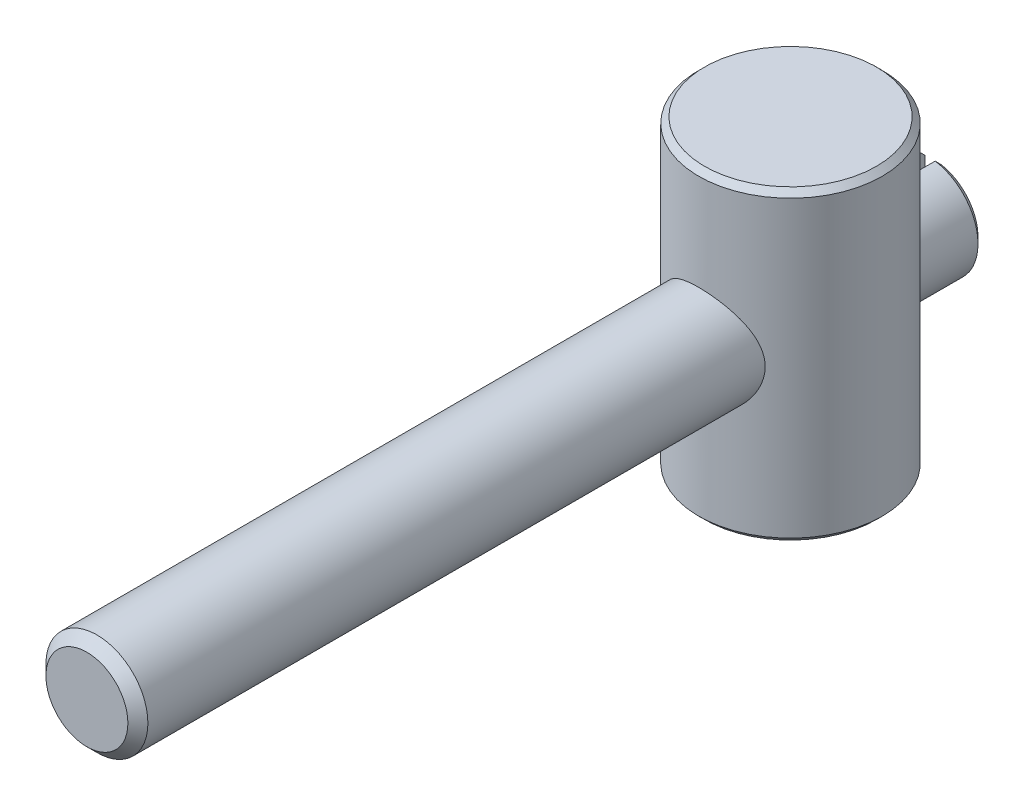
ISO-10303-21;
HEADER;
FILE_DESCRIPTION(('STEP AP214'),'2;1');
FILE_NAME('part.step','',(''),(''),'','','');
FILE_SCHEMA(('AUTOMOTIVE_DESIGN { 1 0 10303 214 1 1 1 1 }'));
ENDSEC;
DATA;
#1=APPLICATION_CONTEXT('core data for automotive mechanical design processes');
#2=APPLICATION_PROTOCOL_DEFINITION('international standard','automotive_design',2000,#1);
#3=PRODUCT_CONTEXT('',#1,'mechanical');
#4=PRODUCT('Part','Part','',(#3));
#5=PRODUCT_RELATED_PRODUCT_CATEGORY('part','',(#4));
#6=PRODUCT_DEFINITION_FORMATION('','',#4);
#7=PRODUCT_DEFINITION_CONTEXT('part definition',#1,'design');
#8=PRODUCT_DEFINITION('design','',#6,#7);
#9=PRODUCT_DEFINITION_SHAPE('','',#8);
#10=(LENGTH_UNIT() NAMED_UNIT(*) SI_UNIT(.MILLI.,.METRE.));
#11=(NAMED_UNIT(*) PLANE_ANGLE_UNIT() SI_UNIT($,.RADIAN.));
#12=(NAMED_UNIT(*) SI_UNIT($,.STERADIAN.) SOLID_ANGLE_UNIT());
#13=UNCERTAINTY_MEASURE_WITH_UNIT(LENGTH_MEASURE(1.E-05),#10,'distance_accuracy_value','');
#14=(GEOMETRIC_REPRESENTATION_CONTEXT(3) GLOBAL_UNCERTAINTY_ASSIGNED_CONTEXT((#13)) GLOBAL_UNIT_ASSIGNED_CONTEXT((#10,
#11,#12)) REPRESENTATION_CONTEXT('',''));
#15=CARTESIAN_POINT('',(0.,0.,0.));
#16=DIRECTION('',(0.,0.,1.));
#17=DIRECTION('',(1.,0.,0.));
#18=AXIS2_PLACEMENT_3D('',#15,#16,#17);
#19=CARTESIAN_POINT('',(2.0095,0.,19.8));
#20=DIRECTION('',(0.,0.,-1.));
#21=DIRECTION('',(-1.,0.,0.));
#22=AXIS2_PLACEMENT_3D('',#19,#20,#21);
#23=PLANE('',#22);
#24=CARTESIAN_POINT('',(0.,0.,19.8));
#25=DIRECTION('',(0.,0.,1.));
#26=DIRECTION('',(1.,0.,0.));
#27=AXIS2_PLACEMENT_3D('',#24,#25,#26);
#28=CIRCLE('',#27,2.0095);
#29=CARTESIAN_POINT('',(2.0095,0.,19.8));
#30=VERTEX_POINT('',#29);
#31=EDGE_CURVE('E138',#30,#30,#28,.T.);
#32=ORIENTED_EDGE('',*,*,#31,.T.);
#33=EDGE_LOOP('',(#32));
#34=FACE_BOUND('',#33,.T.);
#35=ADVANCED_FACE('F14',(#34),#23,.F.);
#36=CARTESIAN_POINT('',(0.,0.,19.3095));
#37=DIRECTION('',(0.,0.,-1.));
#38=DIRECTION('',(-1.,0.,0.));
#39=AXIS2_PLACEMENT_3D('',#36,#37,#38);
#40=CONICAL_SURFACE('',#39,2.5,0.785398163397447);
#41=ORIENTED_EDGE('',*,*,#31,.F.);
#42=EDGE_LOOP('',(#41));
#43=FACE_BOUND('',#42,.T.);
#44=CARTESIAN_POINT('',(0.,0.,19.3095));
#45=DIRECTION('',(0.,0.,1.));
#46=DIRECTION('',(1.,0.,0.));
#47=AXIS2_PLACEMENT_3D('',#44,#45,#46);
#48=CIRCLE('',#47,2.5);
#49=CARTESIAN_POINT('',(2.5,0.,19.3095));
#50=VERTEX_POINT('',#49);
#51=EDGE_CURVE('E134',#50,#50,#48,.T.);
#52=ORIENTED_EDGE('',*,*,#51,.T.);
#53=EDGE_LOOP('',(#52));
#54=FACE_BOUND('',#53,.T.);
#55=ADVANCED_FACE('F226',(#43,#54),#40,.T.);
#56=CARTESIAN_POINT('',(0.,0.,-10.2));
#57=DIRECTION('',(0.,0.,1.));
#58=DIRECTION('',(1.,0.,0.));
#59=AXIS2_PLACEMENT_3D('',#56,#57,#58);
#60=CYLINDRICAL_SURFACE('',#59,2.5);
#61=ORIENTED_EDGE('',*,*,#51,.F.);
#62=EDGE_LOOP('',(#61));
#63=FACE_BOUND('',#62,.T.);
#64=CARTESIAN_POINT('',(2.5,0.,-10.9583426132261));
#65=CARTESIAN_POINT('',(2.4999886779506,-0.127867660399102,-10.9583273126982));
#66=CARTESIAN_POINT('',(2.49012046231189,-0.255847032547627,-10.9516829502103));
#67=CARTESIAN_POINT('',(2.45123834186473,-0.507679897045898,-10.92615160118));
#68=CARTESIAN_POINT('',(2.42219296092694,-0.631526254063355,-10.9072444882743));
#69=CARTESIAN_POINT('',(2.34672518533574,-0.870945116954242,-10.8601006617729));
#70=CARTESIAN_POINT('',(2.30041313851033,-0.986564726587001,-10.8319233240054));
#71=CARTESIAN_POINT('',(2.19206578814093,-1.20834600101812,-10.7695105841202));
#72=CARTESIAN_POINT('',(2.13002699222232,-1.31450555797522,-10.7352738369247));
#73=CARTESIAN_POINT('',(1.98449846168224,-1.52641671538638,-10.6603059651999));
#74=CARTESIAN_POINT('',(1.89945493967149,-1.63099357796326,-10.6192693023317));
#75=CARTESIAN_POINT('',(1.71353751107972,-1.82534633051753,-10.5377770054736));
#76=CARTESIAN_POINT('',(1.61265398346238,-1.91511315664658,-10.4973217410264));
#77=CARTESIAN_POINT('',(1.3870985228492,-2.08508983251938,-10.4173035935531));
#78=CARTESIAN_POINT('',(1.26111369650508,-2.16376032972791,-10.3781335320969));
#79=CARTESIAN_POINT('',(0.995108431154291,-2.29824166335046,-10.3092628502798));
#80=CARTESIAN_POINT('',(0.855099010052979,-2.35407027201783,-10.2795548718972));
#81=CARTESIAN_POINT('',(0.577542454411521,-2.43630568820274,-10.2351937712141));
#82=CARTESIAN_POINT('',(0.440787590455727,-2.46480060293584,-10.2194803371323));
#83=CARTESIAN_POINT('',(0.163616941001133,-2.49853448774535,-10.2008373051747));
#84=CARTESIAN_POINT('',(0.0232040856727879,-2.50379152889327,-10.1978977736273));
#85=CARTESIAN_POINT('',(-0.241178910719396,-2.4914765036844,-10.2047304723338));
#86=CARTESIAN_POINT('',(-0.365303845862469,-2.47628215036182,-10.2131788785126));
#87=CARTESIAN_POINT('',(-0.608906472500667,-2.42789099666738,-10.2397034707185));
#88=CARTESIAN_POINT('',(-0.728383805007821,-2.39469280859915,-10.2577803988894));
#89=CARTESIAN_POINT('',(-0.960979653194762,-2.31126649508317,-10.3021939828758));
#90=CARTESIAN_POINT('',(-1.07401990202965,-2.26086630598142,-10.3286138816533));
#91=CARTESIAN_POINT('',(-1.29025059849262,-2.14483738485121,-10.3874800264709));
#92=CARTESIAN_POINT('',(-1.39343793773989,-2.07920386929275,-10.4199281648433));
#93=CARTESIAN_POINT('',(-1.59909620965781,-1.92640653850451,-10.4921471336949));
#94=CARTESIAN_POINT('',(-1.70025747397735,-1.83767397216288,-10.5323306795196));
#95=CARTESIAN_POINT('',(-1.88703556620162,-1.64533173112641,-10.6134989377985));
#96=CARTESIAN_POINT('',(-1.97263574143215,-1.54170632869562,-10.6544844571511));
#97=CARTESIAN_POINT('',(-2.13367090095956,-1.31107929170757,-10.736876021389));
#98=CARTESIAN_POINT('',(-2.2074790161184,-1.1828097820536,-10.7779828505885));
#99=CARTESIAN_POINT('',(-2.30082855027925,-0.98066900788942,-10.8325082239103));
#100=CARTESIAN_POINT('',(-2.32905476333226,-0.91165285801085,-10.8494965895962));
#101=CARTESIAN_POINT('',(-2.3793879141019,-0.770776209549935,-10.8803947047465));
#102=CARTESIAN_POINT('',(-2.4014990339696,-0.698917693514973,-10.8943065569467));
#103=CARTESIAN_POINT('',(-2.43774893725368,-0.558744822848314,-10.9174339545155));
#104=CARTESIAN_POINT('',(-2.45238335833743,-0.490605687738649,-10.92693581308));
#105=CARTESIAN_POINT('',(-2.47593920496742,-0.352979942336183,-10.9423512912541));
#106=CARTESIAN_POINT('',(-2.48486399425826,-0.283494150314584,-10.9482670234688));
#107=CARTESIAN_POINT('',(-2.49684067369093,-0.143844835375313,-10.9562264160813));
#108=CARTESIAN_POINT('',(-2.49989709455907,-0.0736818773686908,-10.9582730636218));
#109=CARTESIAN_POINT('',(-2.5000979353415,0.0666321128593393,-10.958408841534));
#110=CARTESIAN_POINT('',(-2.49724303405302,0.136783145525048,-10.9564984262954));
#111=CARTESIAN_POINT('',(-2.48160454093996,0.325212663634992,-10.9460933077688));
#112=CARTESIAN_POINT('',(-2.4632791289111,0.442885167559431,-10.9339318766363));
#113=CARTESIAN_POINT('',(-2.41059641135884,0.673061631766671,-10.9000032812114));
#114=CARTESIAN_POINT('',(-2.37623178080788,0.785563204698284,-10.8782317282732));
#115=CARTESIAN_POINT('',(-2.29111009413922,1.00774180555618,-10.8265799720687));
#116=CARTESIAN_POINT('',(-2.23973536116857,1.11711092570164,-10.796402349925));
#117=CARTESIAN_POINT('',(-2.12255957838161,1.32632576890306,-10.7314706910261));
#118=CARTESIAN_POINT('',(-2.05675148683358,1.42616680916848,-10.6967144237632));
#119=CARTESIAN_POINT('',(-1.90016864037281,1.63049062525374,-10.6197869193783));
#120=CARTESIAN_POINT('',(-1.80707526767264,1.73309682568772,-10.5773277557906));
#121=CARTESIAN_POINT('',(-1.60470900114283,1.92199935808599,-10.4944234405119));
#122=CARTESIAN_POINT('',(-1.49542618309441,2.00828561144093,-10.453979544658));
#123=CARTESIAN_POINT('',(-1.25626042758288,2.16643294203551,-10.376991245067));
#124=CARTESIAN_POINT('',(-1.12558547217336,2.23726807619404,-10.3407737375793));
#125=CARTESIAN_POINT('',(-0.851602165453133,2.35519631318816,-10.2790936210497));
#126=CARTESIAN_POINT('',(-0.708307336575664,2.40231447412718,-10.2536196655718));
#127=CARTESIAN_POINT('',(-0.428990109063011,2.46664777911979,-10.218514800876));
#128=CARTESIAN_POINT('',(-0.293732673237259,2.48643742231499,-10.2075252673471));
#129=CARTESIAN_POINT('',(-0.0213910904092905,2.50362240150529,-10.1979932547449));
#130=CARTESIAN_POINT('',(0.115692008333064,2.50103007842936,-10.1994439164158));
#131=CARTESIAN_POINT('',(0.374337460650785,2.47491437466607,-10.2138982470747));
#132=CARTESIAN_POINT('',(0.49616574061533,2.45334235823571,-10.2258246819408));
#133=CARTESIAN_POINT('',(0.734167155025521,2.39292228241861,-10.2586674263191));
#134=CARTESIAN_POINT('',(0.8503396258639,2.3540722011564,-10.279584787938));
#135=CARTESIAN_POINT('',(1.0781477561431,2.25905612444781,-10.3294567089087));
#136=CARTESIAN_POINT('',(1.18950897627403,2.202363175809,-10.358652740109));
#137=CARTESIAN_POINT('',(1.40148896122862,2.07393542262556,-10.422372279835));
#138=CARTESIAN_POINT('',(1.50210346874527,2.00219469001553,-10.4568978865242));
#139=CARTESIAN_POINT('',(1.70217916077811,1.83613517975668,-10.532828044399));
#140=CARTESIAN_POINT('',(1.8001424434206,1.74016022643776,-10.5745654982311));
#141=CARTESIAN_POINT('',(1.97933250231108,1.53330418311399,-10.6574745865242));
#142=CARTESIAN_POINT('',(2.06053826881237,1.42240466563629,-10.6986454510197));
#143=CARTESIAN_POINT('',(2.20944802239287,1.17899936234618,-10.7787759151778));
#144=CARTESIAN_POINT('',(2.27579178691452,1.04552040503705,-10.8173734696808));
#145=CARTESIAN_POINT('',(2.35707752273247,0.83652666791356,-10.8665699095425));
#146=CARTESIAN_POINT('',(2.38112244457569,0.765460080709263,-10.881510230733));
#147=CARTESIAN_POINT('',(2.4228459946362,0.620861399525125,-10.9078467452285));
#148=CARTESIAN_POINT('',(2.44052862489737,0.547330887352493,-10.9192451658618));
#149=CARTESIAN_POINT('',(2.4697920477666,0.395409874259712,-10.9382915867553));
#150=CARTESIAN_POINT('',(2.48109451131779,0.316943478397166,-10.9457676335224));
#151=CARTESIAN_POINT('',(2.49620181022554,0.158999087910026,-10.9557977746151));
#152=CARTESIAN_POINT('',(2.50000704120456,0.0795211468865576,-10.9583521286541));
#153=CARTESIAN_POINT('',(2.5,0.,-10.9583426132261));
#154=B_SPLINE_CURVE_WITH_KNOTS('',3,(#64,#65,#66,#67,#68,#69,#70,#71,#72,#73,#74,#75,#76,#77,
#78,#79,#80,#81,#82,#83,#84,#85,#86,#87,#88,#89,#90,#91,#92,#93,#94,#95,#96,#97,#98,#99,#100,
#101,#102,#103,#104,#105,#106,#107,#108,#109,#110,#111,#112,#113,#114,#115,#116,#117,#118,#119,
#120,#121,#122,#123,#124,#125,#126,#127,#128,#129,#130,#131,#132,#133,#134,#135,#136,#137,#138,
#139,#140,#141,#142,#143,#144,#145,#146,#147,#148,#149,#150,#151,#152,#153),.UNSPECIFIED.,.T.,
.F.,(4,2,2,2,2,2,2,2,2,2,2,2,2,2,2,2,2,2,2,2,2,2,2,2,2,2,2,2,2,2,2,2,2,2,2,2,2,2,2,2,2,2,2,2,4),
(0.,0.383275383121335,0.767181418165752,1.14867490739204,1.53025318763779,1.95124472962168,
2.37249297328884,2.8308639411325,3.2888775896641,3.70817544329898,4.12714717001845,
4.50138183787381,4.8756453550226,5.25376784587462,5.63200923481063,6.05157027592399,
6.47157769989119,6.92969119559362,7.15882945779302,7.38781062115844,7.59850621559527,
7.80907756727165,8.01948627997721,8.22987083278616,8.58719279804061,8.94467811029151,
9.31690871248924,9.68932132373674,10.122176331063,10.5552977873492,11.0117233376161,
11.4676656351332,11.8767730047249,12.2856548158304,12.6568475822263,13.0280837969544,
13.4115163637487,13.7951002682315,14.2233400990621,14.6521136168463,15.1111969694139,
15.3403711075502,15.5694008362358,15.80777312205,16.0461328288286),.UNSPECIFIED.);
#155=CARTESIAN_POINT('',(2.5,0.,-10.9583426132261));
#156=VERTEX_POINT('',#155);
#157=EDGE_CURVE('E23',#156,#156,#154,.T.);
#158=ORIENTED_EDGE('',*,*,#157,.F.);
#159=EDGE_LOOP('',(#158));
#160=FACE_BOUND('',#159,.T.);
#161=ADVANCED_FACE('F217',(#63,#160),#60,.T.);
#162=CARTESIAN_POINT('',(0.,0.,-21.3935));
#163=DIRECTION('',(0.,0.,1.));
#164=DIRECTION('',(1.,0.,0.));
#165=AXIS2_PLACEMENT_3D('',#162,#163,#164);
#166=CIRCLE('',#165,2.5);
#167=CARTESIAN_POINT('',(-0.4,2.46779253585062,-21.3935));
#168=VERTEX_POINT('',#167);
#169=CARTESIAN_POINT('',(-0.4,-2.46779253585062,-21.3935));
#170=VERTEX_POINT('',#169);
#171=EDGE_CURVE('E122',#168,#170,#166,.T.);
#172=ORIENTED_EDGE('',*,*,#171,.T.);
#173=DIRECTION('',(0.,0.,1.));
#174=VECTOR('',#173,1.);
#175=CARTESIAN_POINT('',(-0.4,-2.46779253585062,-10.2));
#176=LINE('',#175,#174);
#177=CARTESIAN_POINT('',(-0.4,-2.46779253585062,-20.296815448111));
#178=VERTEX_POINT('',#177);
#179=EDGE_CURVE('E39',#170,#178,#176,.T.);
#180=ORIENTED_EDGE('',*,*,#179,.T.);
#181=CARTESIAN_POINT('',(0.4,-2.46779253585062,-20.296815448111));
#182=CARTESIAN_POINT('',(0.333698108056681,-2.47854531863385,-20.2976618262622));
#183=CARTESIAN_POINT('',(0.266959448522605,-2.48661458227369,-20.298300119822));
#184=CARTESIAN_POINT('',(0.133478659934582,-2.49732458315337,-20.2991493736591));
#185=CARTESIAN_POINT('',(0.066739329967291,-2.5,-20.2993630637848));
#186=CARTESIAN_POINT('',(-0.066739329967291,-2.5,-20.2993630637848));
#187=CARTESIAN_POINT('',(-0.133478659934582,-2.49732458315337,-20.2991493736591));
#188=CARTESIAN_POINT('',(-0.266959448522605,-2.48661458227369,-20.298300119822));
#189=CARTESIAN_POINT('',(-0.333698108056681,-2.47854531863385,-20.2976618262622));
#190=CARTESIAN_POINT('',(-0.4,-2.46779253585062,-20.296815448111));
#191=B_SPLINE_CURVE_WITH_KNOTS('',3,(#181,#182,#183,#184,#185,#186,#187,#188,#189,#190),
.UNSPECIFIED.,.F.,.F.,(4,2,2,2,4),(0.,0.201464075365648,0.401628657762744,0.601793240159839,
0.803257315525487),.UNSPECIFIED.);
#192=CARTESIAN_POINT('',(0.4,-2.46779253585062,-20.296815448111));
#193=VERTEX_POINT('',#192);
#194=EDGE_CURVE('E76',#193,#178,#191,.T.);
#195=ORIENTED_EDGE('',*,*,#194,.F.);
#196=DIRECTION('',(0.,0.,1.));
#197=VECTOR('',#196,1.);
#198=CARTESIAN_POINT('',(0.4,-2.46779253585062,-10.2));
#199=LINE('',#198,#197);
#200=CARTESIAN_POINT('',(0.4,-2.46779253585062,-21.3935));
#201=VERTEX_POINT('',#200);
#202=EDGE_CURVE('E68',#201,#193,#199,.T.);
#203=ORIENTED_EDGE('',*,*,#202,.F.);
#204=CARTESIAN_POINT('',(0.4,2.46779253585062,-21.3935));
#205=VERTEX_POINT('',#204);
#206=EDGE_CURVE('E130',#201,#205,#166,.T.);
#207=ORIENTED_EDGE('',*,*,#206,.T.);
#208=DIRECTION('',(0.,0.,1.));
#209=VECTOR('',#208,1.);
#210=CARTESIAN_POINT('',(0.4,2.46779253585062,-10.2));
#211=LINE('',#210,#209);
#212=CARTESIAN_POINT('',(0.4,2.46779253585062,-20.296815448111));
#213=VERTEX_POINT('',#212);
#214=EDGE_CURVE('E117',#213,#205,#211,.F.);
#215=ORIENTED_EDGE('',*,*,#214,.F.);
#216=CARTESIAN_POINT('',(-0.4,2.46779253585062,-20.296815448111));
#217=CARTESIAN_POINT('',(-0.333698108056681,2.47854531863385,-20.2976618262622));
#218=CARTESIAN_POINT('',(-0.266959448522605,2.48661458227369,-20.298300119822));
#219=CARTESIAN_POINT('',(-0.133478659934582,2.49732458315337,-20.2991493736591));
#220=CARTESIAN_POINT('',(-0.066739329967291,2.5,-20.2993630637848));
#221=CARTESIAN_POINT('',(0.066739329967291,2.5,-20.2993630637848));
#222=CARTESIAN_POINT('',(0.133478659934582,2.49732458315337,-20.2991493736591));
#223=CARTESIAN_POINT('',(0.266959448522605,2.48661458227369,-20.298300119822));
#224=CARTESIAN_POINT('',(0.333698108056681,2.47854531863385,-20.2976618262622));
#225=CARTESIAN_POINT('',(0.4,2.46779253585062,-20.296815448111));
#226=B_SPLINE_CURVE_WITH_KNOTS('',3,(#216,#217,#218,#219,#220,#221,#222,#223,#224,#225),
.UNSPECIFIED.,.F.,.F.,(4,2,2,2,4),(0.,0.201464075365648,0.401628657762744,0.601793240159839,
0.803257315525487),.UNSPECIFIED.);
#227=CARTESIAN_POINT('',(-0.4,2.46779253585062,-20.296815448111));
#228=VERTEX_POINT('',#227);
#229=EDGE_CURVE('E82',#228,#213,#226,.T.);
#230=ORIENTED_EDGE('',*,*,#229,.F.);
#231=DIRECTION('',(0.,0.,1.));
#232=VECTOR('',#231,1.);
#233=CARTESIAN_POINT('',(-0.4,2.46779253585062,-10.2));
#234=LINE('',#233,#232);
#235=EDGE_CURVE('E77',#228,#168,#234,.F.);
#236=ORIENTED_EDGE('',*,*,#235,.T.);
#237=EDGE_LOOP('',(#172,#180,#195,#203,#207,#215,#230,#236));
#238=FACE_BOUND('',#237,.T.);
#239=CARTESIAN_POINT('',(2.5,0.,-18.441657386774));
#240=CARTESIAN_POINT('',(2.4999886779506,0.127867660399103,-18.4416726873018));
#241=CARTESIAN_POINT('',(2.49012046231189,0.255847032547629,-18.4483170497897));
#242=CARTESIAN_POINT('',(2.45123834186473,0.507679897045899,-18.47384839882));
#243=CARTESIAN_POINT('',(2.42219296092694,0.631526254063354,-18.4927555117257));
#244=CARTESIAN_POINT('',(2.34672518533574,0.870945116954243,-18.5398993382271));
#245=CARTESIAN_POINT('',(2.30041313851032,0.986564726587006,-18.5680766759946));
#246=CARTESIAN_POINT('',(2.19206578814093,1.20834600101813,-18.6304894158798));
#247=CARTESIAN_POINT('',(2.13002699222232,1.31450555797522,-18.6647261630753));
#248=CARTESIAN_POINT('',(1.98449846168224,1.52641671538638,-18.7396940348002));
#249=CARTESIAN_POINT('',(1.89945493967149,1.63099357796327,-18.7807306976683));
#250=CARTESIAN_POINT('',(1.71353751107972,1.82534633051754,-18.8622229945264));
#251=CARTESIAN_POINT('',(1.61265398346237,1.91511315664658,-18.9026782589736));
#252=CARTESIAN_POINT('',(1.3870985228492,2.08508983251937,-18.982696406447));
#253=CARTESIAN_POINT('',(1.26111369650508,2.16376032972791,-19.0218664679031));
#254=CARTESIAN_POINT('',(0.995108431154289,2.29824166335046,-19.0907371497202));
#255=CARTESIAN_POINT('',(0.855099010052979,2.35407027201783,-19.1204451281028));
#256=CARTESIAN_POINT('',(0.577542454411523,2.43630568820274,-19.1648062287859));
#257=CARTESIAN_POINT('',(0.440787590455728,2.46480060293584,-19.1805196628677));
#258=CARTESIAN_POINT('',(0.163616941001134,2.49853448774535,-19.1991626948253));
#259=CARTESIAN_POINT('',(0.0232040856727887,2.50379152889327,-19.2021022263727));
#260=CARTESIAN_POINT('',(-0.241178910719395,2.4914765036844,-19.1952695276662));
#261=CARTESIAN_POINT('',(-0.365303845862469,2.47628215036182,-19.1868211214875));
#262=CARTESIAN_POINT('',(-0.608906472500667,2.42789099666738,-19.1602965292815));
#263=CARTESIAN_POINT('',(-0.728383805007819,2.39469280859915,-19.1422196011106));
#264=CARTESIAN_POINT('',(-0.960979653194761,2.31126649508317,-19.0978060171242));
#265=CARTESIAN_POINT('',(-1.07401990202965,2.26086630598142,-19.0713861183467));
#266=CARTESIAN_POINT('',(-1.29025059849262,2.14483738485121,-19.0125199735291));
#267=CARTESIAN_POINT('',(-1.39343793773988,2.07920386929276,-18.9800718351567));
#268=CARTESIAN_POINT('',(-1.59909620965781,1.9264065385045,-18.9078528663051));
#269=CARTESIAN_POINT('',(-1.70025747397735,1.83767397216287,-18.8676693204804));
#270=CARTESIAN_POINT('',(-1.88703556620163,1.64533173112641,-18.7865010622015));
#271=CARTESIAN_POINT('',(-1.97263574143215,1.54170632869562,-18.7455155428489));
#272=CARTESIAN_POINT('',(-2.13367090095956,1.31107929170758,-18.663123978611));
#273=CARTESIAN_POINT('',(-2.2074790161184,1.1828097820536,-18.6220171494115));
#274=CARTESIAN_POINT('',(-2.30082855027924,0.980669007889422,-18.5674917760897));
#275=CARTESIAN_POINT('',(-2.32905476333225,0.911652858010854,-18.5505034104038));
#276=CARTESIAN_POINT('',(-2.3793879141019,0.770776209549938,-18.5196052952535));
#277=CARTESIAN_POINT('',(-2.4014990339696,0.698917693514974,-18.5056934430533));
#278=CARTESIAN_POINT('',(-2.43774893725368,0.558744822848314,-18.4825660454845));
#279=CARTESIAN_POINT('',(-2.45238335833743,0.490605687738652,-18.47306418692));
#280=CARTESIAN_POINT('',(-2.47593920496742,0.352979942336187,-18.4576487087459));
#281=CARTESIAN_POINT('',(-2.48486399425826,0.283494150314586,-18.4517329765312));
#282=CARTESIAN_POINT('',(-2.49684067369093,0.143844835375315,-18.4437735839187));
#283=CARTESIAN_POINT('',(-2.49989709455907,0.0736818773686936,-18.4417269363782));
#284=CARTESIAN_POINT('',(-2.5000979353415,-0.0666321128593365,-18.441591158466));
#285=CARTESIAN_POINT('',(-2.49724303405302,-0.136783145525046,-18.4435015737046));
#286=CARTESIAN_POINT('',(-2.48160454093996,-0.325212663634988,-18.4539066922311));
#287=CARTESIAN_POINT('',(-2.46327912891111,-0.442885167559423,-18.4660681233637));
#288=CARTESIAN_POINT('',(-2.41059641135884,-0.673061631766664,-18.4999967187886));
#289=CARTESIAN_POINT('',(-2.37623178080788,-0.785563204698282,-18.5217682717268));
#290=CARTESIAN_POINT('',(-2.29111009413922,-1.00774180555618,-18.5734200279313));
#291=CARTESIAN_POINT('',(-2.23973536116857,-1.11711092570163,-18.603597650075));
#292=CARTESIAN_POINT('',(-2.12255957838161,-1.32632576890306,-18.668529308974));
#293=CARTESIAN_POINT('',(-2.05675148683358,-1.42616680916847,-18.7032855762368));
#294=CARTESIAN_POINT('',(-1.90016864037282,-1.63049062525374,-18.7802130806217));
#295=CARTESIAN_POINT('',(-1.80707526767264,-1.73309682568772,-18.8226722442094));
#296=CARTESIAN_POINT('',(-1.60470900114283,-1.92199935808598,-18.9055765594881));
#297=CARTESIAN_POINT('',(-1.49542618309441,-2.00828561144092,-18.946020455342));
#298=CARTESIAN_POINT('',(-1.25626042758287,-2.16643294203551,-19.0230087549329));
#299=CARTESIAN_POINT('',(-1.12558547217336,-2.23726807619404,-19.0592262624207));
#300=CARTESIAN_POINT('',(-0.851602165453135,-2.35519631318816,-19.1209063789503));
#301=CARTESIAN_POINT('',(-0.708307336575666,-2.40231447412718,-19.1463803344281));
#302=CARTESIAN_POINT('',(-0.428990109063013,-2.46664777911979,-19.181485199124));
#303=CARTESIAN_POINT('',(-0.293732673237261,-2.48643742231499,-19.1924747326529));
#304=CARTESIAN_POINT('',(-0.0213910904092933,-2.50362240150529,-19.2020067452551));
#305=CARTESIAN_POINT('',(0.115692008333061,-2.50103007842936,-19.2005560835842));
#306=CARTESIAN_POINT('',(0.374337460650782,-2.47491437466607,-19.1861017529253));
#307=CARTESIAN_POINT('',(0.496165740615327,-2.45334235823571,-19.1741753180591));
#308=CARTESIAN_POINT('',(0.73416715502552,-2.39292228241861,-19.1413325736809));
#309=CARTESIAN_POINT('',(0.8503396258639,-2.3540722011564,-19.120415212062));
#310=CARTESIAN_POINT('',(1.07814775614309,-2.25905612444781,-19.0705432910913));
#311=CARTESIAN_POINT('',(1.18950897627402,-2.202363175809,-19.041347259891));
#312=CARTESIAN_POINT('',(1.40148896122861,-2.07393542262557,-18.977627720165));
#313=CARTESIAN_POINT('',(1.50210346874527,-2.00219469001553,-18.9431021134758));
#314=CARTESIAN_POINT('',(1.7021791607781,-1.83613517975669,-18.867171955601));
#315=CARTESIAN_POINT('',(1.80014244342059,-1.74016022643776,-18.825434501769));
#316=CARTESIAN_POINT('',(1.97933250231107,-1.533304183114,-18.7425254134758));
#317=CARTESIAN_POINT('',(2.06053826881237,-1.42240466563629,-18.7013545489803));
#318=CARTESIAN_POINT('',(2.20944802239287,-1.17899936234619,-18.6212240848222));
#319=CARTESIAN_POINT('',(2.27579178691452,-1.04552040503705,-18.5826265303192));
#320=CARTESIAN_POINT('',(2.35707752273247,-0.83652666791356,-18.5334300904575));
#321=CARTESIAN_POINT('',(2.38112244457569,-0.765460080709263,-18.518489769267));
#322=CARTESIAN_POINT('',(2.4228459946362,-0.620861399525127,-18.4921532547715));
#323=CARTESIAN_POINT('',(2.44052862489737,-0.547330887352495,-18.4807548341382));
#324=CARTESIAN_POINT('',(2.4697920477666,-0.395409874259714,-18.4617084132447));
#325=CARTESIAN_POINT('',(2.48109451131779,-0.316943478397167,-18.4542323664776));
#326=CARTESIAN_POINT('',(2.49620181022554,-0.158999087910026,-18.4442022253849));
#327=CARTESIAN_POINT('',(2.50000704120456,-0.0795211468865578,-18.4416478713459));
#328=CARTESIAN_POINT('',(2.5,0.,-18.441657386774));
#329=B_SPLINE_CURVE_WITH_KNOTS('',3,(#239,#240,#241,#242,#243,#244,#245,#246,#247,#248,#249,
#250,#251,#252,#253,#254,#255,#256,#257,#258,#259,#260,#261,#262,#263,#264,#265,#266,#267,#268,
#269,#270,#271,#272,#273,#274,#275,#276,#277,#278,#279,#280,#281,#282,#283,#284,#285,#286,#287,
#288,#289,#290,#291,#292,#293,#294,#295,#296,#297,#298,#299,#300,#301,#302,#303,#304,#305,#306,
#307,#308,#309,#310,#311,#312,#313,#314,#315,#316,#317,#318,#319,#320,#321,#322,#323,#324,#325,
#326,#327,#328),.UNSPECIFIED.,.T.,.F.,(4,2,2,2,2,2,2,2,2,2,2,2,2,2,2,2,2,2,2,2,2,2,2,2,2,2,2,2,
2,2,2,2,2,2,2,2,2,2,2,2,2,2,2,2,4),(0.,0.383275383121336,0.767181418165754,1.14867490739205,
1.53025318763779,1.95124472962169,2.37249297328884,2.8308639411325,3.2888775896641,
3.70817544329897,4.12714717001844,4.50138183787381,4.8756453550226,5.25376784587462,
5.63200923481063,6.05157027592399,6.47157769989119,6.92969119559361,7.15882945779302,
7.38781062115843,7.59850621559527,7.80907756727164,8.0194862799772,8.22987083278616,
8.5871927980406,8.9446781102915,9.31690871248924,9.68932132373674,10.122176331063,
10.5552977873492,11.0117233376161,11.4676656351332,11.8767730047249,12.2856548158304,
12.6568475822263,13.0280837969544,13.4115163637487,13.7951002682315,14.2233400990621,
14.6521136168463,15.1111969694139,15.3403711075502,15.5694008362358,15.80777312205,
16.0461328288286),.UNSPECIFIED.);
#330=CARTESIAN_POINT('',(2.5,0.,-18.441657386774));
#331=VERTEX_POINT('',#330);
#332=EDGE_CURVE('E9',#331,#331,#329,.T.);
#333=ORIENTED_EDGE('',*,*,#332,.F.);
#334=EDGE_LOOP('',(#333));
#335=FACE_BOUND('',#334,.T.);
#336=ADVANCED_FACE('F87',(#238,#335),#60,.T.);
#337=CARTESIAN_POINT('',(0.,0.,-21.7));
#338=DIRECTION('',(0.,0.,1.));
#339=DIRECTION('',(1.,0.,0.));
#340=AXIS2_PLACEMENT_3D('',#337,#338,#339);
#341=PLANE('',#340);
#342=DIRECTION('',(0.,-1.,0.));
#343=VECTOR('',#342,1.);
#344=CARTESIAN_POINT('',(0.4,0.,-21.7));
#345=LINE('',#344,#343);
#346=CARTESIAN_POINT('',(0.4,2.15672025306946,-21.7));
#347=VERTEX_POINT('',#346);
#348=CARTESIAN_POINT('',(0.4,-2.15672025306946,-21.7));
#349=VERTEX_POINT('',#348);
#350=EDGE_CURVE('E149',#347,#349,#345,.T.);
#351=ORIENTED_EDGE('',*,*,#350,.F.);
#352=CARTESIAN_POINT('',(0.,0.,-21.7));
#353=DIRECTION('',(0.,0.,1.));
#354=DIRECTION('',(1.,0.,0.));
#355=AXIS2_PLACEMENT_3D('',#352,#353,#354);
#356=CIRCLE('',#355,2.1935);
#357=EDGE_CURVE('E129',#349,#347,#356,.T.);
#358=ORIENTED_EDGE('',*,*,#357,.F.);
#359=EDGE_LOOP('',(#351,#358));
#360=FACE_BOUND('',#359,.T.);
#361=ADVANCED_FACE('F216',(#360),#341,.F.);
#362=CARTESIAN_POINT('',(0.,0.,-21.7));
#363=DIRECTION('',(0.,0.,1.));
#364=DIRECTION('',(1.,0.,0.));
#365=AXIS2_PLACEMENT_3D('',#362,#363,#364);
#366=CONICAL_SURFACE('',#365,2.1935,0.785398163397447);
#367=CARTESIAN_POINT('',(0.4,2.46850166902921,-21.3928));
#368=CARTESIAN_POINT('',(0.4,2.39793497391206,-21.4624547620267));
#369=CARTESIAN_POINT('',(0.4,2.32733326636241,-21.5320741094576));
#370=CARTESIAN_POINT('',(0.4,2.18597809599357,-21.6712614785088));
#371=CARTESIAN_POINT('',(0.4,2.11522456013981,-21.7408294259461));
#372=CARTESIAN_POINT('',(0.4,1.97263911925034,-21.8807619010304));
#373=CARTESIAN_POINT('',(0.4,1.90080545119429,-21.9511246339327));
#374=CARTESIAN_POINT('',(0.4,1.75700155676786,-22.0916061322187));
#375=CARTESIAN_POINT('',(0.4,1.68503146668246,-22.1617250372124));
#376=CARTESIAN_POINT('',(0.4,1.5086325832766,-22.3329478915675));
#377=CARTESIAN_POINT('',(0.4,1.40406116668,-22.4339055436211));
#378=CARTESIAN_POINT('',(0.4,1.24630024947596,-22.5846719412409));
#379=CARTESIAN_POINT('',(0.4,1.1934932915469,-22.6348806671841));
#380=CARTESIAN_POINT('',(0.4,1.08751861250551,-22.73488634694));
#381=CARTESIAN_POINT('',(0.4,1.03435099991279,-22.7846834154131));
#382=CARTESIAN_POINT('',(0.4,0.928027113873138,-22.8831356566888));
#383=CARTESIAN_POINT('',(0.4,0.87487688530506,-22.9317973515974));
#384=CARTESIAN_POINT('',(0.4,0.767646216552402,-23.0282154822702));
#385=CARTESIAN_POINT('',(0.4,0.713564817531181,-23.0759708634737));
#386=CARTESIAN_POINT('',(0.4,0.63143350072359,-23.1461630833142));
#387=CARTESIAN_POINT('',(0.4,0.603955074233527,-23.1692668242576));
#388=CARTESIAN_POINT('',(0.4,0.548479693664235,-23.2148412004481));
#389=CARTESIAN_POINT('',(0.4,0.520482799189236,-23.2373119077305));
#390=CARTESIAN_POINT('',(0.4,0.463815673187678,-23.2812861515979));
#391=CARTESIAN_POINT('',(0.4,0.435146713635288,-23.3027913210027));
#392=CARTESIAN_POINT('',(0.4,0.376790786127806,-23.3443654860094));
#393=CARTESIAN_POINT('',(0.4,0.347104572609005,-23.364435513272));
#394=CARTESIAN_POINT('',(0.4,0.309473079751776,-23.3877901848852));
#395=CARTESIAN_POINT('',(0.4,0.302223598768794,-23.3921969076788));
#396=CARTESIAN_POINT('',(0.4,0.287631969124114,-23.4008566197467));
#397=CARTESIAN_POINT('',(0.4,0.28028980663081,-23.4051095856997));
#398=CARTESIAN_POINT('',(0.4,0.258114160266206,-23.4176076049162));
#399=CARTESIAN_POINT('',(0.4,0.243131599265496,-23.4255917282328));
#400=CARTESIAN_POINT('',(0.4,0.212839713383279,-23.4405880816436));
#401=CARTESIAN_POINT('',(0.4,0.197534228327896,-23.4476079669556));
#402=CARTESIAN_POINT('',(0.4,0.166442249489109,-23.460484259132));
#403=CARTESIAN_POINT('',(0.4,0.150655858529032,-23.4663409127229));
#404=CARTESIAN_POINT('',(0.4,0.111435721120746,-23.4788472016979));
#405=CARTESIAN_POINT('',(0.4,0.0877285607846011,-23.4846874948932));
#406=CARTESIAN_POINT('',(0.4,0.0397057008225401,-23.4922264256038));
#407=CARTESIAN_POINT('',(0.4,0.0153922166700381,-23.4939383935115));
#408=CARTESIAN_POINT('',(0.4,-0.0331703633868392,-23.4928640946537));
#409=CARTESIAN_POINT('',(0.4,-0.0574192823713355,-23.4900702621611));
#410=CARTESIAN_POINT('',(0.4,-0.10517632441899,-23.4805736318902));
#411=CARTESIAN_POINT('',(0.4,-0.128681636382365,-23.4738575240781));
#412=CARTESIAN_POINT('',(0.4,-0.178283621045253,-23.4562788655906));
#413=CARTESIAN_POINT('',(0.4,-0.20420033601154,-23.4449277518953));
#414=CARTESIAN_POINT('',(0.4,-0.254817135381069,-23.4197398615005));
#415=CARTESIAN_POINT('',(0.4,-0.279514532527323,-23.4058978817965));
#416=CARTESIAN_POINT('',(0.4,-0.328121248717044,-23.3765020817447));
#417=CARTESIAN_POINT('',(0.4,-0.352022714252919,-23.3609354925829));
#418=CARTESIAN_POINT('',(0.4,-0.399055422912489,-23.3287412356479));
#419=CARTESIAN_POINT('',(0.4,-0.422187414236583,-23.3121146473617));
#420=CARTESIAN_POINT('',(0.4,-0.4702689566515,-23.2763546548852));
#421=CARTESIAN_POINT('',(0.4,-0.495157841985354,-23.2571402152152));
#422=CARTESIAN_POINT('',(0.4,-0.544438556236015,-23.21808210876));
#423=CARTESIAN_POINT('',(0.4,-0.568830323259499,-23.1982383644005));
#424=CARTESIAN_POINT('',(0.4,-0.641472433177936,-23.1380236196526));
#425=CARTESIAN_POINT('',(0.4,-0.689168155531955,-23.0969855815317));
#426=CARTESIAN_POINT('',(0.4,-0.783758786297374,-23.013853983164));
#427=CARTESIAN_POINT('',(0.4,-0.83065225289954,-22.9717588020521));
#428=CARTESIAN_POINT('',(0.4,-0.923855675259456,-22.8869523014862));
#429=CARTESIAN_POINT('',(0.4,-0.970165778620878,-22.8442411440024));
#430=CARTESIAN_POINT('',(0.4,-1.10817311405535,-22.7158338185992));
#431=CARTESIAN_POINT('',(0.4,-1.19931044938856,-22.6295376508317));
#432=CARTESIAN_POINT('',(0.4,-1.38074793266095,-22.4562216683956));
#433=CARTESIAN_POINT('',(0.4,-1.47104870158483,-22.3692024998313));
#434=CARTESIAN_POINT('',(0.4,-1.63710859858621,-22.2083381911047));
#435=CARTESIAN_POINT('',(0.4,-1.71293348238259,-22.1345609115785));
#436=CARTESIAN_POINT('',(0.4,-1.86438262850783,-21.9867617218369));
#437=CARTESIAN_POINT('',(0.4,-1.94000683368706,-21.9127397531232));
#438=CARTESIAN_POINT('',(0.4,-2.09118466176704,-21.7644543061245));
#439=CARTESIAN_POINT('',(0.4,-2.16673811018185,-21.6901906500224));
#440=CARTESIAN_POINT('',(0.4,-2.31770791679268,-21.5415644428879));
#441=CARTESIAN_POINT('',(0.4,-2.39312430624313,-21.4672019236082));
#442=CARTESIAN_POINT('',(0.4,-2.46850166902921,-21.3928));
#443=B_SPLINE_CURVE_WITH_KNOTS('',3,(#367,#368,#369,#370,#371,#372,#373,#374,#375,#376,#377,
#378,#379,#380,#381,#382,#383,#384,#385,#386,#387,#388,#389,#390,#391,#392,#393,#394,#395,#396,
#397,#398,#399,#400,#401,#402,#403,#404,#405,#406,#407,#408,#409,#410,#411,#412,#413,#414,#415,
#416,#417,#418,#419,#420,#421,#422,#423,#424,#425,#426,#427,#428,#429,#430,#431,#432,#433,#434,
#435,#436,#437,#438,#439,#440,#441,#442),.UNSPECIFIED.,.F.,.F.,(4,2,2,2,2,2,2,2,2,2,2,2,2,2,2,2,
2,2,2,2,2,2,2,2,2,2,2,2,2,2,2,2,2,2,2,2,2,4),(0.,0.29746095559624,0.595138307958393,
0.896798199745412,1.19823998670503,1.63429513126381,1.85289273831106,2.07142725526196,
2.28760816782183,2.5040268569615,2.61172252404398,2.71940588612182,2.82689970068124,
2.93431544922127,2.9597650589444,2.98521851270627,3.0361257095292,3.08660196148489,
3.13706749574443,3.2100182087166,3.28273304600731,3.35557010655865,3.42865578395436,
3.51332827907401,3.5981797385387,3.68370773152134,3.76914997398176,3.86346381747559,
3.95778933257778,4.14652139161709,4.33556300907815,4.52455579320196,4.90107746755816,
5.27729270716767,5.59467575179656,5.91214113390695,6.22996283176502,6.54769954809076),.UNSPECIFIED.);
#444=EDGE_CURVE('E330',#205,#347,#443,.T.);
#445=ORIENTED_EDGE('',*,*,#444,.F.);
#446=ORIENTED_EDGE('',*,*,#206,.F.);
#447=EDGE_CURVE('E71',#349,#201,#443,.T.);
#448=ORIENTED_EDGE('',*,*,#447,.F.);
#449=ORIENTED_EDGE('',*,*,#357,.T.);
#450=EDGE_LOOP('',(#445,#446,#448,#449));
#451=FACE_BOUND('',#450,.T.);
#452=ADVANCED_FACE('F223',(#451),#366,.T.);
#453=CARTESIAN_POINT('',(-0.4,2.15672025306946,-21.7));
#454=VERTEX_POINT('',#453);
#455=CARTESIAN_POINT('',(-0.4,-2.15672025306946,-21.7));
#456=VERTEX_POINT('',#455);
#457=EDGE_CURVE('E133',#454,#456,#356,.T.);
#458=ORIENTED_EDGE('',*,*,#457,.F.);
#459=DIRECTION('',(0.,-1.,0.));
#460=VECTOR('',#459,1.);
#461=CARTESIAN_POINT('',(-0.4,0.,-21.7));
#462=LINE('',#461,#460);
#463=EDGE_CURVE('E141',#454,#456,#462,.T.);
#464=ORIENTED_EDGE('',*,*,#463,.T.);
#465=EDGE_LOOP('',(#458,#464));
#466=FACE_BOUND('',#465,.T.);
#467=ADVANCED_FACE('F225',(#466),#341,.F.);
#468=ORIENTED_EDGE('',*,*,#171,.F.);
#469=CARTESIAN_POINT('',(-0.4,2.46850166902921,-21.3928));
#470=CARTESIAN_POINT('',(-0.4,2.39793497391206,-21.4624547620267));
#471=CARTESIAN_POINT('',(-0.4,2.32733326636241,-21.5320741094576));
#472=CARTESIAN_POINT('',(-0.4,2.18597809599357,-21.6712614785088));
#473=CARTESIAN_POINT('',(-0.4,2.11522456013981,-21.7408294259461));
#474=CARTESIAN_POINT('',(-0.4,1.97263911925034,-21.8807619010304));
#475=CARTESIAN_POINT('',(-0.4,1.90080545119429,-21.9511246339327));
#476=CARTESIAN_POINT('',(-0.4,1.75700155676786,-22.0916061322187));
#477=CARTESIAN_POINT('',(-0.4,1.68503146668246,-22.1617250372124));
#478=CARTESIAN_POINT('',(-0.4,1.5086325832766,-22.3329478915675));
#479=CARTESIAN_POINT('',(-0.4,1.40406116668,-22.4339055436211));
#480=CARTESIAN_POINT('',(-0.4,1.24630024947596,-22.5846719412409));
#481=CARTESIAN_POINT('',(-0.4,1.1934932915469,-22.6348806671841));
#482=CARTESIAN_POINT('',(-0.4,1.08751861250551,-22.73488634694));
#483=CARTESIAN_POINT('',(-0.4,1.03435099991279,-22.7846834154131));
#484=CARTESIAN_POINT('',(-0.4,0.928027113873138,-22.8831356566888));
#485=CARTESIAN_POINT('',(-0.4,0.87487688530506,-22.9317973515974));
#486=CARTESIAN_POINT('',(-0.4,0.767646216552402,-23.0282154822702));
#487=CARTESIAN_POINT('',(-0.4,0.713564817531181,-23.0759708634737));
#488=CARTESIAN_POINT('',(-0.4,0.63143350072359,-23.1461630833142));
#489=CARTESIAN_POINT('',(-0.4,0.603955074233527,-23.1692668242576));
#490=CARTESIAN_POINT('',(-0.4,0.548479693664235,-23.2148412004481));
#491=CARTESIAN_POINT('',(-0.4,0.520482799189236,-23.2373119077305));
#492=CARTESIAN_POINT('',(-0.4,0.463815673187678,-23.2812861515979));
#493=CARTESIAN_POINT('',(-0.4,0.435146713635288,-23.3027913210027));
#494=CARTESIAN_POINT('',(-0.4,0.376790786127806,-23.3443654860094));
#495=CARTESIAN_POINT('',(-0.4,0.347104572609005,-23.364435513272));
#496=CARTESIAN_POINT('',(-0.4,0.309473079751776,-23.3877901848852));
#497=CARTESIAN_POINT('',(-0.4,0.302223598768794,-23.3921969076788));
#498=CARTESIAN_POINT('',(-0.4,0.287631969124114,-23.4008566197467));
#499=CARTESIAN_POINT('',(-0.4,0.28028980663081,-23.4051095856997));
#500=CARTESIAN_POINT('',(-0.4,0.258114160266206,-23.4176076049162));
#501=CARTESIAN_POINT('',(-0.4,0.243131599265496,-23.4255917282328));
#502=CARTESIAN_POINT('',(-0.4,0.212839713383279,-23.4405880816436));
#503=CARTESIAN_POINT('',(-0.4,0.197534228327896,-23.4476079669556));
#504=CARTESIAN_POINT('',(-0.4,0.166442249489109,-23.460484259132));
#505=CARTESIAN_POINT('',(-0.4,0.150655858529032,-23.4663409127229));
#506=CARTESIAN_POINT('',(-0.4,0.111435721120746,-23.4788472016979));
#507=CARTESIAN_POINT('',(-0.4,0.0877285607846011,-23.4846874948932));
#508=CARTESIAN_POINT('',(-0.4,0.0397057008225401,-23.4922264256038));
#509=CARTESIAN_POINT('',(-0.4,0.0153922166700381,-23.4939383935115));
#510=CARTESIAN_POINT('',(-0.4,-0.0331703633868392,-23.4928640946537));
#511=CARTESIAN_POINT('',(-0.4,-0.0574192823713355,-23.4900702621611));
#512=CARTESIAN_POINT('',(-0.4,-0.10517632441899,-23.4805736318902));
#513=CARTESIAN_POINT('',(-0.4,-0.128681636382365,-23.4738575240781));
#514=CARTESIAN_POINT('',(-0.4,-0.178283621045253,-23.4562788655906));
#515=CARTESIAN_POINT('',(-0.4,-0.20420033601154,-23.4449277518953));
#516=CARTESIAN_POINT('',(-0.4,-0.254817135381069,-23.4197398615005));
#517=CARTESIAN_POINT('',(-0.4,-0.279514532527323,-23.4058978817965));
#518=CARTESIAN_POINT('',(-0.4,-0.328121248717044,-23.3765020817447));
#519=CARTESIAN_POINT('',(-0.4,-0.352022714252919,-23.3609354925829));
#520=CARTESIAN_POINT('',(-0.4,-0.399055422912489,-23.3287412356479));
#521=CARTESIAN_POINT('',(-0.4,-0.422187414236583,-23.3121146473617));
#522=CARTESIAN_POINT('',(-0.4,-0.4702689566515,-23.2763546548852));
#523=CARTESIAN_POINT('',(-0.4,-0.495157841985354,-23.2571402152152));
#524=CARTESIAN_POINT('',(-0.4,-0.544438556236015,-23.21808210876));
#525=CARTESIAN_POINT('',(-0.4,-0.568830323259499,-23.1982383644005));
#526=CARTESIAN_POINT('',(-0.4,-0.641472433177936,-23.1380236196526));
#527=CARTESIAN_POINT('',(-0.4,-0.689168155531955,-23.0969855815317));
#528=CARTESIAN_POINT('',(-0.4,-0.783758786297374,-23.013853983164));
#529=CARTESIAN_POINT('',(-0.4,-0.83065225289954,-22.9717588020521));
#530=CARTESIAN_POINT('',(-0.4,-0.923855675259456,-22.8869523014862));
#531=CARTESIAN_POINT('',(-0.4,-0.970165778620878,-22.8442411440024));
#532=CARTESIAN_POINT('',(-0.4,-1.10817311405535,-22.7158338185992));
#533=CARTESIAN_POINT('',(-0.4,-1.19931044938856,-22.6295376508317));
#534=CARTESIAN_POINT('',(-0.4,-1.38074793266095,-22.4562216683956));
#535=CARTESIAN_POINT('',(-0.4,-1.47104870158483,-22.3692024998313));
#536=CARTESIAN_POINT('',(-0.4,-1.63710859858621,-22.2083381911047));
#537=CARTESIAN_POINT('',(-0.4,-1.71293348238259,-22.1345609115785));
#538=CARTESIAN_POINT('',(-0.4,-1.86438262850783,-21.9867617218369));
#539=CARTESIAN_POINT('',(-0.4,-1.94000683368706,-21.9127397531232));
#540=CARTESIAN_POINT('',(-0.4,-2.09118466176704,-21.7644543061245));
#541=CARTESIAN_POINT('',(-0.4,-2.16673811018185,-21.6901906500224));
#542=CARTESIAN_POINT('',(-0.4,-2.31770791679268,-21.5415644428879));
#543=CARTESIAN_POINT('',(-0.4,-2.39312430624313,-21.4672019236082));
#544=CARTESIAN_POINT('',(-0.4,-2.46850166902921,-21.3928));
#545=B_SPLINE_CURVE_WITH_KNOTS('',3,(#469,#470,#471,#472,#473,#474,#475,#476,#477,#478,#479,
#480,#481,#482,#483,#484,#485,#486,#487,#488,#489,#490,#491,#492,#493,#494,#495,#496,#497,#498,
#499,#500,#501,#502,#503,#504,#505,#506,#507,#508,#509,#510,#511,#512,#513,#514,#515,#516,#517,
#518,#519,#520,#521,#522,#523,#524,#525,#526,#527,#528,#529,#530,#531,#532,#533,#534,#535,#536,
#537,#538,#539,#540,#541,#542,#543,#544),.UNSPECIFIED.,.F.,.F.,(4,2,2,2,2,2,2,2,2,2,2,2,2,2,2,2,
2,2,2,2,2,2,2,2,2,2,2,2,2,2,2,2,2,2,2,2,2,4),(0.,0.29746095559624,0.595138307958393,
0.896798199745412,1.19823998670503,1.63429513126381,1.85289273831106,2.07142725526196,
2.28760816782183,2.5040268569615,2.61172252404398,2.71940588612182,2.82689970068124,
2.93431544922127,2.9597650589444,2.98521851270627,3.0361257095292,3.08660196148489,
3.13706749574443,3.2100182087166,3.28273304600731,3.35557010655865,3.42865578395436,
3.51332827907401,3.5981797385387,3.68370773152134,3.76914997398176,3.86346381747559,
3.95778933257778,4.14652139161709,4.33556300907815,4.52455579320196,4.90107746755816,
5.27729270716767,5.59467575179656,5.91214113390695,6.22996283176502,6.54769954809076),.UNSPECIFIED.);
#546=EDGE_CURVE('E126',#168,#454,#545,.T.);
#547=ORIENTED_EDGE('',*,*,#546,.T.);
#548=ORIENTED_EDGE('',*,*,#457,.T.);
#549=EDGE_CURVE('E128',#456,#170,#545,.T.);
#550=ORIENTED_EDGE('',*,*,#549,.T.);
#551=EDGE_LOOP('',(#468,#547,#548,#550));
#552=FACE_BOUND('',#551,.T.);
#553=ADVANCED_FACE('F107',(#552),#366,.T.);
#554=CARTESIAN_POINT('',(-0.4,0.,-51.7));
#555=DIRECTION('',(1.,0.,0.));
#556=DIRECTION('',(0.,-1.,0.));
#557=AXIS2_PLACEMENT_3D('',#554,#555,#556);
#558=CYLINDRICAL_SURFACE('',#557,31.5);
#559=CARTESIAN_POINT('',(-0.4,0.,-51.7));
#560=DIRECTION('',(-1.,0.,0.));
#561=DIRECTION('',(0.,1.,0.));
#562=AXIS2_PLACEMENT_3D('',#559,#560,#561);
#563=CIRCLE('',#562,31.5);
#564=EDGE_CURVE('E84',#178,#228,#563,.T.);
#565=ORIENTED_EDGE('',*,*,#564,.T.);
#566=ORIENTED_EDGE('',*,*,#229,.T.);
#567=CARTESIAN_POINT('',(0.4,0.,-51.7));
#568=DIRECTION('',(-1.,0.,0.));
#569=DIRECTION('',(0.,1.,0.));
#570=AXIS2_PLACEMENT_3D('',#567,#568,#569);
#571=CIRCLE('',#570,31.5);
#572=EDGE_CURVE('E31',#193,#213,#571,.T.);
#573=ORIENTED_EDGE('',*,*,#572,.F.);
#574=ORIENTED_EDGE('',*,*,#194,.T.);
#575=EDGE_LOOP('',(#565,#566,#573,#574));
#576=FACE_BOUND('',#575,.T.);
#577=ADVANCED_FACE('F81',(#576),#558,.F.);
#578=CARTESIAN_POINT('',(-0.4,0.,-51.7));
#579=DIRECTION('',(-1.,0.,0.));
#580=DIRECTION('',(0.,1.,0.));
#581=AXIS2_PLACEMENT_3D('',#578,#579,#580);
#582=PLANE('',#581);
#583=ORIENTED_EDGE('',*,*,#549,.F.);
#584=ORIENTED_EDGE('',*,*,#463,.F.);
#585=ORIENTED_EDGE('',*,*,#546,.F.);
#586=ORIENTED_EDGE('',*,*,#235,.F.);
#587=ORIENTED_EDGE('',*,*,#564,.F.);
#588=ORIENTED_EDGE('',*,*,#179,.F.);
#589=EDGE_LOOP('',(#583,#584,#585,#586,#587,#588));
#590=FACE_BOUND('',#589,.T.);
#591=ADVANCED_FACE('F106',(#590),#582,.F.);
#592=CARTESIAN_POINT('',(0.4,0.,-51.7));
#593=DIRECTION('',(-1.,0.,0.));
#594=DIRECTION('',(0.,1.,0.));
#595=AXIS2_PLACEMENT_3D('',#592,#593,#594);
#596=PLANE('',#595);
#597=ORIENTED_EDGE('',*,*,#202,.T.);
#598=ORIENTED_EDGE('',*,*,#572,.T.);
#599=ORIENTED_EDGE('',*,*,#214,.T.);
#600=ORIENTED_EDGE('',*,*,#444,.T.);
#601=ORIENTED_EDGE('',*,*,#350,.T.);
#602=ORIENTED_EDGE('',*,*,#447,.T.);
#603=EDGE_LOOP('',(#597,#598,#599,#600,#601,#602));
#604=FACE_BOUND('',#603,.T.);
#605=ADVANCED_FACE('F69',(#604),#596,.T.);
#606=CARTESIAN_POINT('',(0.,-7.5,-14.7));
#607=DIRECTION('',(0.,1.,0.));
#608=DIRECTION('',(1.,0.,0.));
#609=AXIS2_PLACEMENT_3D('',#606,#607,#608);
#610=PLANE('',#609);
#611=CARTESIAN_POINT('',(0.,-7.5,-14.7));
#612=DIRECTION('',(0.,1.,0.));
#613=DIRECTION('',(1.,0.,0.));
#614=AXIS2_PLACEMENT_3D('',#611,#612,#613);
#615=CIRCLE('',#614,4.21715728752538);
#616=CARTESIAN_POINT('',(4.21715728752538,-7.5,-14.7));
#617=VERTEX_POINT('',#616);
#618=EDGE_CURVE('E18',#617,#617,#615,.T.);
#619=ORIENTED_EDGE('',*,*,#618,.F.);
#620=EDGE_LOOP('',(#619));
#621=FACE_BOUND('',#620,.T.);
#622=ADVANCED_FACE('F16',(#621),#610,.F.);
#623=CARTESIAN_POINT('',(0.,7.5,-18.9171572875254));
#624=DIRECTION('',(0.,-1.,0.));
#625=DIRECTION('',(-1.,0.,0.));
#626=AXIS2_PLACEMENT_3D('',#623,#624,#625);
#627=PLANE('',#626);
#628=CARTESIAN_POINT('',(0.,7.5,-14.7));
#629=DIRECTION('',(0.,1.,0.));
#630=DIRECTION('',(1.,0.,0.));
#631=AXIS2_PLACEMENT_3D('',#628,#629,#630);
#632=CIRCLE('',#631,4.21715728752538);
#633=CARTESIAN_POINT('',(4.21715728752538,7.5,-14.7));
#634=VERTEX_POINT('',#633);
#635=EDGE_CURVE('E179',#634,#634,#632,.T.);
#636=ORIENTED_EDGE('',*,*,#635,.T.);
#637=EDGE_LOOP('',(#636));
#638=FACE_BOUND('',#637,.T.);
#639=ADVANCED_FACE('F161',(#638),#627,.F.);
#640=CARTESIAN_POINT('',(0.,-7.5,-14.7));
#641=DIRECTION('',(0.,1.,0.));
#642=DIRECTION('',(1.,0.,0.));
#643=AXIS2_PLACEMENT_3D('',#640,#641,#642);
#644=CONICAL_SURFACE('',#643,4.21715728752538,0.78539816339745);
#645=CARTESIAN_POINT('',(0.,-7.21715728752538,-14.7));
#646=DIRECTION('',(0.,1.,0.));
#647=DIRECTION('',(1.,0.,0.));
#648=AXIS2_PLACEMENT_3D('',#645,#646,#647);
#649=CIRCLE('',#648,4.5);
#650=CARTESIAN_POINT('',(4.5,-7.21715728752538,-14.7));
#651=VERTEX_POINT('',#650);
#652=EDGE_CURVE('E173',#651,#651,#649,.T.);
#653=ORIENTED_EDGE('',*,*,#652,.F.);
#654=EDGE_LOOP('',(#653));
#655=FACE_BOUND('',#654,.T.);
#656=ORIENTED_EDGE('',*,*,#618,.T.);
#657=EDGE_LOOP('',(#656));
#658=FACE_BOUND('',#657,.T.);
#659=ADVANCED_FACE('F167',(#655,#658),#644,.T.);
#660=CARTESIAN_POINT('',(0.,7.21715728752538,-14.7));
#661=DIRECTION('',(0.,-1.,0.));
#662=DIRECTION('',(-1.,0.,0.));
#663=AXIS2_PLACEMENT_3D('',#660,#661,#662);
#664=CONICAL_SURFACE('',#663,4.5,0.785398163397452);
#665=ORIENTED_EDGE('',*,*,#635,.F.);
#666=EDGE_LOOP('',(#665));
#667=FACE_BOUND('',#666,.T.);
#668=CARTESIAN_POINT('',(0.,7.21715728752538,-14.7));
#669=DIRECTION('',(0.,1.,0.));
#670=DIRECTION('',(1.,0.,0.));
#671=AXIS2_PLACEMENT_3D('',#668,#669,#670);
#672=CIRCLE('',#671,4.5);
#673=CARTESIAN_POINT('',(4.5,7.21715728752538,-14.7));
#674=VERTEX_POINT('',#673);
#675=EDGE_CURVE('E175',#674,#674,#672,.T.);
#676=ORIENTED_EDGE('',*,*,#675,.T.);
#677=EDGE_LOOP('',(#676));
#678=FACE_BOUND('',#677,.T.);
#679=ADVANCED_FACE('F194',(#667,#678),#664,.T.);
#680=CARTESIAN_POINT('',(0.,7.5,-14.7));
#681=DIRECTION('',(0.,1.,0.));
#682=DIRECTION('',(1.,0.,0.));
#683=AXIS2_PLACEMENT_3D('',#680,#681,#682);
#684=CYLINDRICAL_SURFACE('',#683,4.5);
#685=ORIENTED_EDGE('',*,*,#675,.F.);
#686=EDGE_LOOP('',(#685));
#687=FACE_BOUND('',#686,.T.);
#688=ORIENTED_EDGE('',*,*,#652,.T.);
#689=EDGE_LOOP('',(#688));
#690=FACE_BOUND('',#689,.T.);
#691=ORIENTED_EDGE('',*,*,#157,.T.);
#692=EDGE_LOOP('',(#691));
#693=FACE_BOUND('',#692,.T.);
#694=ORIENTED_EDGE('',*,*,#332,.T.);
#695=EDGE_LOOP('',(#694));
#696=FACE_BOUND('',#695,.T.);
#697=ADVANCED_FACE('F190',(#687,#690,#693,#696),#684,.T.);
#698=CLOSED_SHELL('',(#35,#55,#161,#336,#361,#452,#467,#553,#577,#591,#605,#622,#639,#659,#679,#697));
#699=MANIFOLD_SOLID_BREP('B1',#698);
#700=ADVANCED_BREP_SHAPE_REPRESENTATION('',(#18,#699),#14);
#701=SHAPE_DEFINITION_REPRESENTATION(#9,#700);
ENDSEC;
END-ISO-10303-21;
